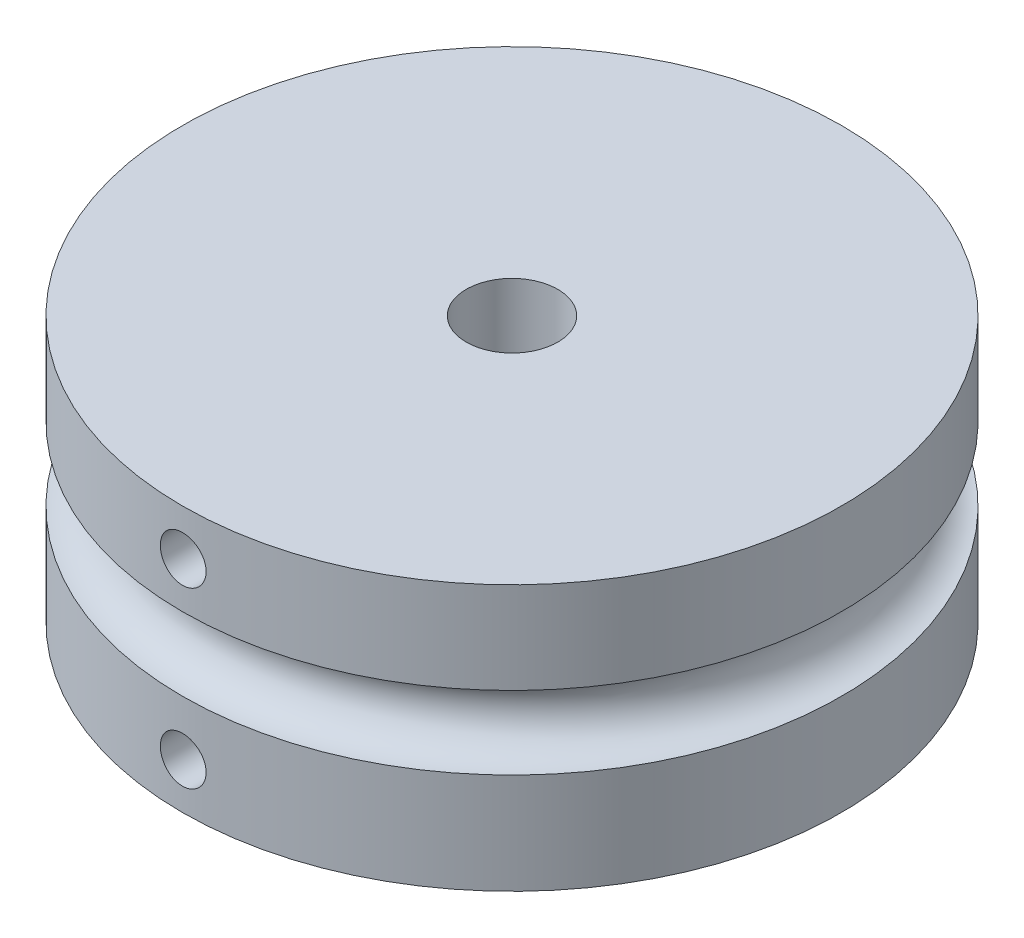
from build123d import *

# Parameters (mm, degrees)
SKETCH1_R                      = 18
BOSS_EXTRUDE1_DEPTH            = 7.25
SKETCH2_R                      = 2
F_5_0MM_DOWEL_HOLE1_D          = 5
M3X0_5_TAPPED_HOLE1_AT_2_COUNT = 2
M3X0_5_TAPPED_HOLE1_AT_2_PITCH = 9.87514946


with BuildPart() as part:
    # Sketch1 → Boss-Extrude1 (new, symmetric)
    with BuildSketch(Plane(origin=(0, 0, 0), x_dir=(1, 0, 0), z_dir=(0, 1, 0))):
        with Locations(Location((0, 0, 0), (0, 0, 90))):
            Circle(SKETCH1_R)
    extrude(amount=BOSS_EXTRUDE1_DEPTH, both=True)

    # Sketch2 → Cut-Revolve1 (revolve, cut)
    with BuildSketch(Plane.XY, mode=Mode.PRIVATE) as cut_revolve1_sk:
        with Locations((-18, 0.25)):
            Circle(SKETCH2_R)
    revolve(cut_revolve1_sk.sketch.rotate(Axis((0, 7.25, 0), (0, -1, 0)), 90), axis=Axis((0, 7.25, 0), (0, -1, 0)), mode=Mode.SUBTRACT)

    # 5.0mm Dowel Hole1 (through all)
    with Locations(Plane(origin=(0, 7.25, 0), x_dir=(1, 0, 0), z_dir=(0, 1, 0))):
        with Locations((0, 0)):
            Hole(F_5_0MM_DOWEL_HOLE1_D / 2)

    # Sketch5 → M3x0.5 Tapped Hole1 (revolve, cut)
    with BuildSketch(Plane(origin=(0, 4.75, 18), x_dir=(0, -1, 0), z_dir=(1, 0, 0))):
        Polygon((0, 0), (0, 18.751075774), (1.25, 18), (1.25, 0), align=None)
    m3x0_5_tapped_hole1 = revolve(axis=Axis((0, 4.75, 24.35), (0, 0, -1)), mode=Mode.SUBTRACT)

    # M3x0.5 Tapped Hole1 at 2: M3x0.5 Tapped Hole1 ×2
    with Locations(*[(0, i * M3X0_5_TAPPED_HOLE1_AT_2_PITCH, 0) for i in range(1, M3X0_5_TAPPED_HOLE1_AT_2_COUNT)]):
        add(m3x0_5_tapped_hole1, mode=Mode.SUBTRACT)

    # Mirror1: M3x0.5 Tapped Hole1 across plane
    add(m3x0_5_tapped_hole1.mirror(Plane.ZX), mode=Mode.SUBTRACT)

    # Mirror1 copy 1 sketch → Mirror1 copy 1 (revolve, cut)
    with BuildSketch(Plane(origin=(0, -14.62514946, 18), x_dir=(0, 1, 0), z_dir=(1, 0, 0))):
        Polygon((0, 0), (0, -18.751075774), (1.25, -18), (1.25, 0), align=None)
    revolve(axis=Axis((0, -14.62514946, 24.35), (0, 0, 1)), mode=Mode.SUBTRACT)


solid = part.part
